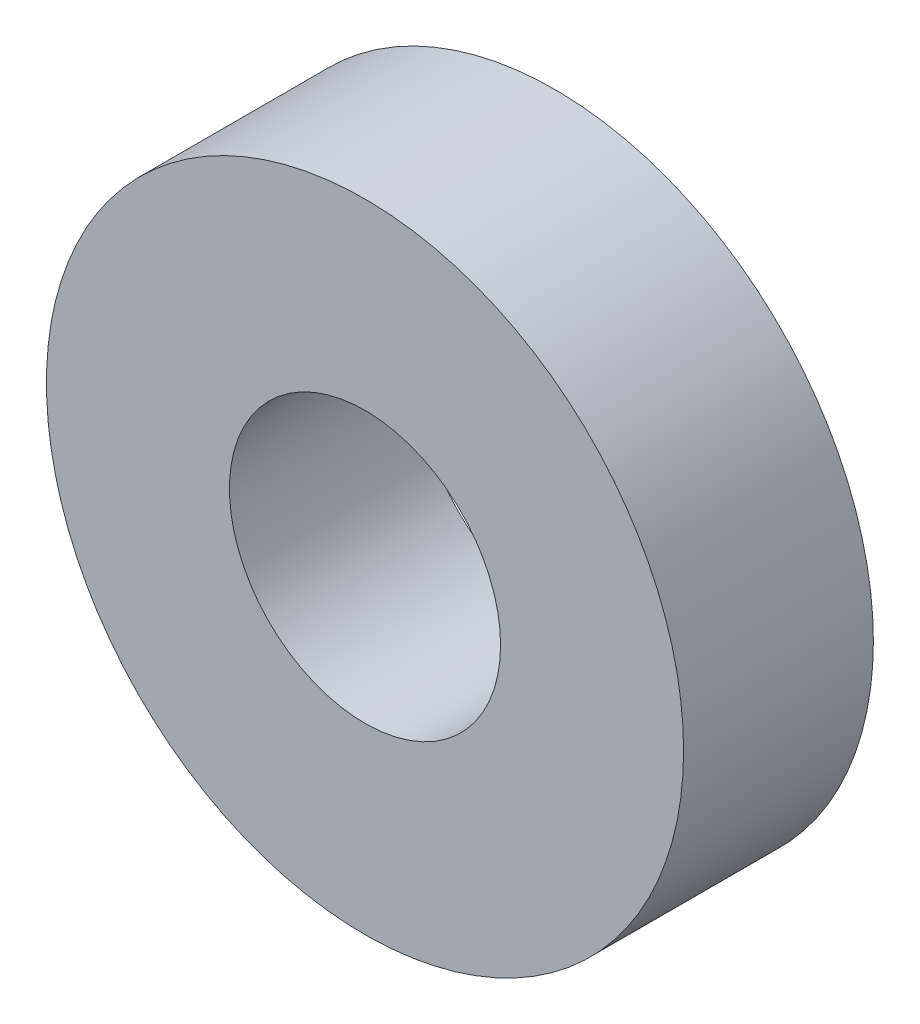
from build123d import *

# Parameters (mm, degrees)
ESQUISSE1_R      = 23.5
ESQUISSE1_R_2    = 10
EXTRUSION1_DEPTH = 14


with BuildPart() as part:
    # Esquisse1 → Extrusion1 (new body)
    with BuildSketch(Plane.XY):
        Circle(ESQUISSE1_R)
        Circle(ESQUISSE1_R_2, mode=Mode.SUBTRACT)
    extrude(amount=EXTRUSION1_DEPTH)


solid = part.part
